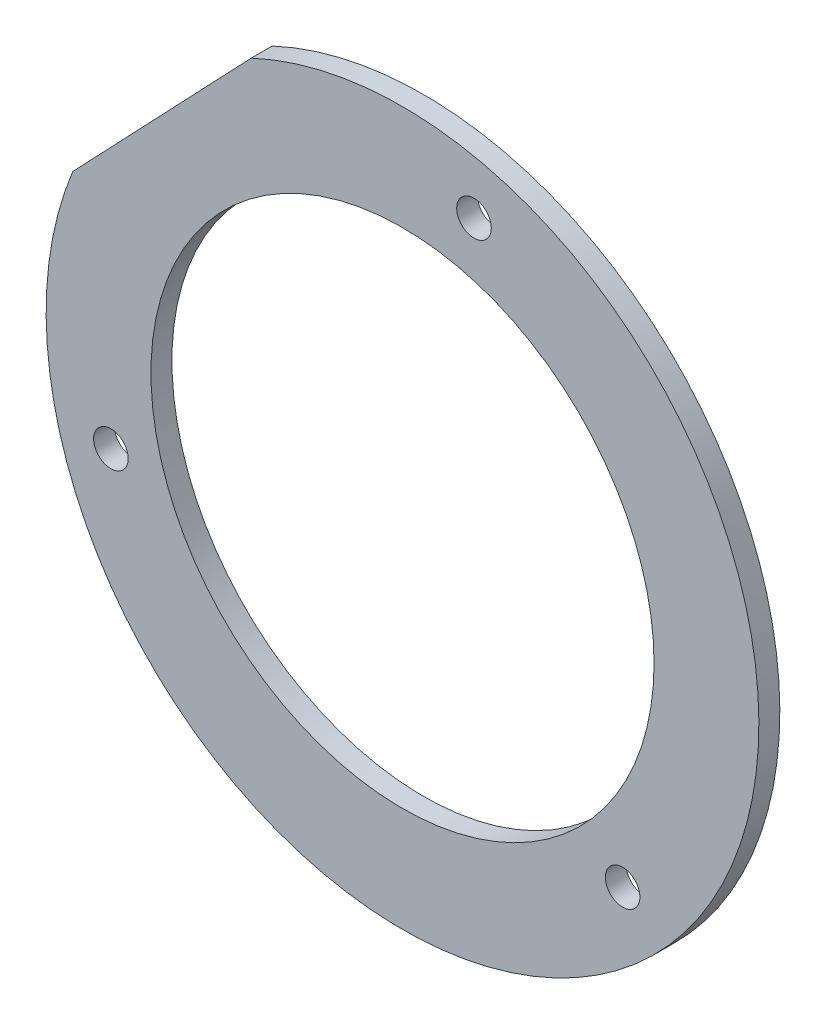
from build123d import *

# Parameters (mm, degrees)
SKETCH_1_R         = 24
EXTRUDE_1_DEPTH    = 2
HOLE_WIZARD_M4_1_D = 3.3


with BuildPart() as part:
    # Sketch 1 → Extrude 1 (new body)
    with BuildSketch(Plane.XY):
        with BuildLine():
            Line((2.569924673, 82.785920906), (-14.452802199, 64.912057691))
            ThreePointArc((-14.452802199, 64.912057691), (41.620689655, 28.551724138), (2.569924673, 82.785920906))
        make_face()
        with Locations((17, 52)):
            Circle(SKETCH_1_R, mode=Mode.SUBTRACT)
    extrude(amount=EXTRUDE_1_DEPTH)

    # Hole Wizard M4 _1 (through all)
    with Locations(Plane.XY.offset(2)):
        with Locations((23.820508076, 80.186533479), (-10.820508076, 43.813466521), (38, 32)):
            Hole(HOLE_WIZARD_M4_1_D / 2)


solid = part.part
